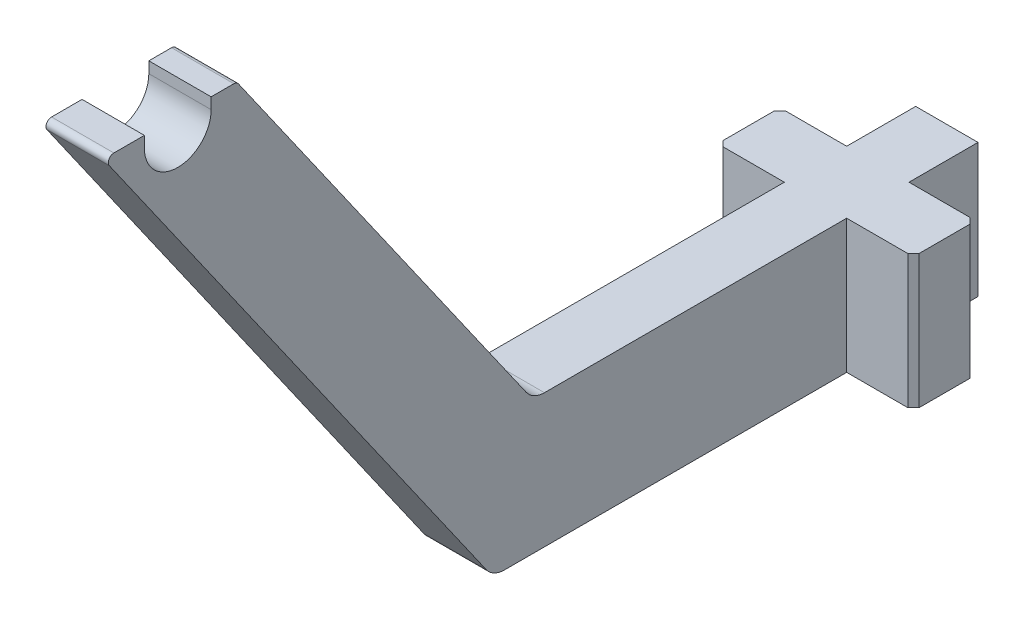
ISO-10303-21;
HEADER;
FILE_DESCRIPTION(('STEP AP214'),'2;1');
FILE_NAME('part.step','',(''),(''),'','','');
FILE_SCHEMA(('AUTOMOTIVE_DESIGN { 1 0 10303 214 1 1 1 1 }'));
ENDSEC;
DATA;
#1=APPLICATION_CONTEXT('core data for automotive mechanical design processes');
#2=APPLICATION_PROTOCOL_DEFINITION('international standard','automotive_design',2000,#1);
#3=PRODUCT_CONTEXT('',#1,'mechanical');
#4=PRODUCT('Part','Part','',(#3));
#5=PRODUCT_RELATED_PRODUCT_CATEGORY('part','',(#4));
#6=PRODUCT_DEFINITION_FORMATION('','',#4);
#7=PRODUCT_DEFINITION_CONTEXT('part definition',#1,'design');
#8=PRODUCT_DEFINITION('design','',#6,#7);
#9=PRODUCT_DEFINITION_SHAPE('','',#8);
#10=(LENGTH_UNIT() NAMED_UNIT(*) SI_UNIT(.MILLI.,.METRE.));
#11=(NAMED_UNIT(*) PLANE_ANGLE_UNIT() SI_UNIT($,.RADIAN.));
#12=(NAMED_UNIT(*) SI_UNIT($,.STERADIAN.) SOLID_ANGLE_UNIT());
#13=UNCERTAINTY_MEASURE_WITH_UNIT(LENGTH_MEASURE(1.E-05),#10,'distance_accuracy_value','');
#14=(GEOMETRIC_REPRESENTATION_CONTEXT(3) GLOBAL_UNCERTAINTY_ASSIGNED_CONTEXT((#13)) GLOBAL_UNIT_ASSIGNED_CONTEXT((#10,
#11,#12)) REPRESENTATION_CONTEXT('',''));
#15=CARTESIAN_POINT('',(0.,0.,0.));
#16=DIRECTION('',(0.,0.,1.));
#17=DIRECTION('',(1.,0.,0.));
#18=AXIS2_PLACEMENT_3D('',#15,#16,#17);
#19=CARTESIAN_POINT('',(1.4,25.,39.3039432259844));
#20=DIRECTION('',(0.,-1.,0.));
#21=DIRECTION('',(0.,0.,-1.));
#22=AXIS2_PLACEMENT_3D('',#19,#20,#21);
#23=PLANE('',#22);
#24=DIRECTION('',(0.,0.,1.));
#25=VECTOR('',#24,1.);
#26=CARTESIAN_POINT('',(-1.4,25.,39.3039432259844));
#27=LINE('',#26,#25);
#28=CARTESIAN_POINT('',(-1.4,25.,37.4538394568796));
#29=VERTEX_POINT('',#28);
#30=CARTESIAN_POINT('',(-1.4,25.,38.8236976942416));
#31=VERTEX_POINT('',#30);
#32=EDGE_CURVE('E223',#29,#31,#27,.T.);
#33=ORIENTED_EDGE('',*,*,#32,.T.);
#34=DIRECTION('',(-1.,0.,0.));
#35=VECTOR('',#34,1.);
#36=CARTESIAN_POINT('',(1.4,25.,38.8236976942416));
#37=LINE('',#36,#35);
#38=CARTESIAN_POINT('',(1.4,25.,38.8236976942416));
#39=VERTEX_POINT('',#38);
#40=EDGE_CURVE('E312',#31,#39,#37,.F.);
#41=ORIENTED_EDGE('',*,*,#40,.T.);
#42=DIRECTION('',(0.,0.,1.));
#43=VECTOR('',#42,1.);
#44=CARTESIAN_POINT('',(1.4,25.,39.3039432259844));
#45=LINE('',#44,#43);
#46=CARTESIAN_POINT('',(1.4,25.,37.4538394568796));
#47=VERTEX_POINT('',#46);
#48=EDGE_CURVE('E226',#47,#39,#45,.T.);
#49=ORIENTED_EDGE('',*,*,#48,.F.);
#50=DIRECTION('',(-1.,0.,0.));
#51=VECTOR('',#50,1.);
#52=CARTESIAN_POINT('',(4.400025,25.,37.4538394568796));
#53=LINE('',#52,#51);
#54=EDGE_CURVE('E210',#47,#29,#53,.T.);
#55=ORIENTED_EDGE('',*,*,#54,.T.);
#56=EDGE_LOOP('',(#33,#41,#49,#55));
#57=FACE_BOUND('',#56,.T.);
#58=ADVANCED_FACE('F35',(#57),#23,.F.);
#59=CARTESIAN_POINT('',(1.4,0.,0.));
#60=DIRECTION('',(-1.,0.,0.));
#61=DIRECTION('',(0.,0.,1.));
#62=AXIS2_PLACEMENT_3D('',#59,#60,#61);
#63=PLANE('',#62);
#64=DIRECTION('',(0.,1.,0.));
#65=VECTOR('',#64,1.);
#66=CARTESIAN_POINT('',(1.4,-4.10365690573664,3.1));
#67=LINE('',#66,#65);
#68=CARTESIAN_POINT('',(1.4,0.,3.1));
#69=VERTEX_POINT('',#68);
#70=CARTESIAN_POINT('',(1.4,6.,3.1));
#71=VERTEX_POINT('',#70);
#72=EDGE_CURVE('E334',#69,#71,#67,.T.);
#73=ORIENTED_EDGE('',*,*,#72,.F.);
#74=DIRECTION('',(0.,0.,-1.));
#75=VECTOR('',#74,1.);
#76=CARTESIAN_POINT('',(1.4,0.,0.));
#77=LINE('',#76,#75);
#78=CARTESIAN_POINT('',(1.4,0.,0.));
#79=VERTEX_POINT('',#78);
#80=EDGE_CURVE('E243',#69,#79,#77,.T.);
#81=ORIENTED_EDGE('',*,*,#80,.T.);
#82=DIRECTION('',(0.,1.,0.));
#83=VECTOR('',#82,1.);
#84=CARTESIAN_POINT('',(1.4,0.,0.));
#85=LINE('',#84,#83);
#86=CARTESIAN_POINT('',(1.4,6.,0.));
#87=VERTEX_POINT('',#86);
#88=EDGE_CURVE('E273',#79,#87,#85,.T.);
#89=ORIENTED_EDGE('',*,*,#88,.T.);
#90=DIRECTION('',(0.,0.,1.));
#91=VECTOR('',#90,1.);
#92=CARTESIAN_POINT('',(1.4,6.,0.));
#93=LINE('',#92,#91);
#94=EDGE_CURVE('E288',#87,#71,#93,.T.);
#95=ORIENTED_EDGE('',*,*,#94,.T.);
#96=EDGE_LOOP('',(#73,#81,#89,#95));
#97=FACE_BOUND('',#96,.T.);
#98=ADVANCED_FACE('F480',(#97),#63,.F.);
#99=CARTESIAN_POINT('',(-1.4,0.,0.));
#100=DIRECTION('',(-1.,0.,0.));
#101=DIRECTION('',(0.,0.,1.));
#102=AXIS2_PLACEMENT_3D('',#99,#100,#101);
#103=PLANE('',#102);
#104=DIRECTION('',(0.,0.,-1.));
#105=VECTOR('',#104,1.);
#106=CARTESIAN_POINT('',(-1.4,0.,0.));
#107=LINE('',#106,#105);
#108=CARTESIAN_POINT('',(-1.4,0.,3.1));
#109=VERTEX_POINT('',#108);
#110=CARTESIAN_POINT('',(-1.4,0.,0.));
#111=VERTEX_POINT('',#110);
#112=EDGE_CURVE('E252',#109,#111,#107,.T.);
#113=ORIENTED_EDGE('',*,*,#112,.F.);
#114=DIRECTION('',(0.,1.,0.));
#115=VECTOR('',#114,1.);
#116=CARTESIAN_POINT('',(-1.4,-4.10365690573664,3.1));
#117=LINE('',#116,#115);
#118=CARTESIAN_POINT('',(-1.4,6.,3.1));
#119=VERTEX_POINT('',#118);
#120=EDGE_CURVE('E404',#109,#119,#117,.T.);
#121=ORIENTED_EDGE('',*,*,#120,.T.);
#122=DIRECTION('',(0.,0.,1.));
#123=VECTOR('',#122,1.);
#124=CARTESIAN_POINT('',(-1.4,6.,0.));
#125=LINE('',#124,#123);
#126=CARTESIAN_POINT('',(-1.4,6.,0.));
#127=VERTEX_POINT('',#126);
#128=EDGE_CURVE('E238',#127,#119,#125,.T.);
#129=ORIENTED_EDGE('',*,*,#128,.F.);
#130=DIRECTION('',(0.,1.,0.));
#131=VECTOR('',#130,1.);
#132=CARTESIAN_POINT('',(-1.4,0.,0.));
#133=LINE('',#132,#131);
#134=EDGE_CURVE('E262',#111,#127,#133,.T.);
#135=ORIENTED_EDGE('',*,*,#134,.F.);
#136=EDGE_LOOP('',(#113,#121,#129,#135));
#137=FACE_BOUND('',#136,.T.);
#138=ADVANCED_FACE('F462',(#137),#103,.T.);
#139=CARTESIAN_POINT('',(1.4,0.,0.));
#140=DIRECTION('',(0.,1.,0.));
#141=DIRECTION('',(0.,0.,1.));
#142=AXIS2_PLACEMENT_3D('',#139,#140,#141);
#143=PLANE('',#142);
#144=DIRECTION('',(-1.,0.,0.));
#145=VECTOR('',#144,1.);
#146=CARTESIAN_POINT('',(-4.4,0.,5.9));
#147=LINE('',#146,#145);
#148=CARTESIAN_POINT('',(-1.4,0.,5.9));
#149=VERTEX_POINT('',#148);
#150=CARTESIAN_POINT('',(-4.15,0.,5.9));
#151=VERTEX_POINT('',#150);
#152=EDGE_CURVE('E398',#149,#151,#147,.T.);
#153=ORIENTED_EDGE('',*,*,#152,.T.);
#154=DIRECTION('',(0.707106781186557,0.,0.707106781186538));
#155=VECTOR('',#154,1.);
#156=CARTESIAN_POINT('',(-4.4,0.,5.65000000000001));
#157=LINE('',#156,#155);
#158=CARTESIAN_POINT('',(-4.4,0.,5.65000000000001));
#159=VERTEX_POINT('',#158);
#160=EDGE_CURVE('E365',#151,#159,#157,.F.);
#161=ORIENTED_EDGE('',*,*,#160,.T.);
#162=DIRECTION('',(0.,0.,-1.));
#163=VECTOR('',#162,1.);
#164=CARTESIAN_POINT('',(-4.4,0.,3.1));
#165=LINE('',#164,#163);
#166=CARTESIAN_POINT('',(-4.4,0.,3.35));
#167=VERTEX_POINT('',#166);
#168=EDGE_CURVE('E395',#159,#167,#165,.T.);
#169=ORIENTED_EDGE('',*,*,#168,.T.);
#170=DIRECTION('',(-0.707106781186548,0.,0.707106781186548));
#171=VECTOR('',#170,1.);
#172=CARTESIAN_POINT('',(-4.15,0.,3.1));
#173=LINE('',#172,#171);
#174=CARTESIAN_POINT('',(-4.15,0.,3.1));
#175=VERTEX_POINT('',#174);
#176=EDGE_CURVE('E363',#167,#175,#173,.F.);
#177=ORIENTED_EDGE('',*,*,#176,.T.);
#178=DIRECTION('',(1.,0.,0.));
#179=VECTOR('',#178,1.);
#180=CARTESIAN_POINT('',(-1.4,0.,3.1));
#181=LINE('',#180,#179);
#182=EDGE_CURVE('E256',#175,#109,#181,.T.);
#183=ORIENTED_EDGE('',*,*,#182,.T.);
#184=ORIENTED_EDGE('',*,*,#112,.T.);
#185=DIRECTION('',(-1.,0.,0.));
#186=VECTOR('',#185,1.);
#187=CARTESIAN_POINT('',(1.4,0.,0.));
#188=LINE('',#187,#186);
#189=EDGE_CURVE('E247',#79,#111,#188,.T.);
#190=ORIENTED_EDGE('',*,*,#189,.F.);
#191=ORIENTED_EDGE('',*,*,#80,.F.);
#192=DIRECTION('',(1.,0.,0.));
#193=VECTOR('',#192,1.);
#194=CARTESIAN_POINT('',(1.4,0.,3.1));
#195=LINE('',#194,#193);
#196=CARTESIAN_POINT('',(4.15,0.,3.1));
#197=VERTEX_POINT('',#196);
#198=EDGE_CURVE('E342',#69,#197,#195,.T.);
#199=ORIENTED_EDGE('',*,*,#198,.T.);
#200=DIRECTION('',(-0.707106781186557,0.,-0.707106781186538));
#201=VECTOR('',#200,1.);
#202=CARTESIAN_POINT('',(4.4,0.,3.34999999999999));
#203=LINE('',#202,#201);
#204=CARTESIAN_POINT('',(4.4,0.,3.34999999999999));
#205=VERTEX_POINT('',#204);
#206=EDGE_CURVE('E359',#197,#205,#203,.F.);
#207=ORIENTED_EDGE('',*,*,#206,.T.);
#208=DIRECTION('',(0.,0.,1.));
#209=VECTOR('',#208,1.);
#210=CARTESIAN_POINT('',(4.4,0.,3.1));
#211=LINE('',#210,#209);
#212=CARTESIAN_POINT('',(4.4,0.,5.65));
#213=VERTEX_POINT('',#212);
#214=EDGE_CURVE('E356',#205,#213,#211,.T.);
#215=ORIENTED_EDGE('',*,*,#214,.T.);
#216=DIRECTION('',(0.707106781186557,0.,-0.707106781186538));
#217=VECTOR('',#216,1.);
#218=CARTESIAN_POINT('',(4.15,0.,5.9));
#219=LINE('',#218,#217);
#220=CARTESIAN_POINT('',(4.15,0.,5.9));
#221=VERTEX_POINT('',#220);
#222=EDGE_CURVE('E50',#213,#221,#219,.F.);
#223=ORIENTED_EDGE('',*,*,#222,.T.);
#224=DIRECTION('',(-1.,0.,0.));
#225=VECTOR('',#224,1.);
#226=CARTESIAN_POINT('',(4.4,0.,5.9));
#227=LINE('',#226,#225);
#228=CARTESIAN_POINT('',(1.4,0.,5.9));
#229=VERTEX_POINT('',#228);
#230=EDGE_CURVE('E345',#221,#229,#227,.T.);
#231=ORIENTED_EDGE('',*,*,#230,.T.);
#232=CARTESIAN_POINT('',(1.4,0.,21.27818772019));
#233=VERTEX_POINT('',#232);
#234=EDGE_CURVE('E269',#233,#229,#77,.T.);
#235=ORIENTED_EDGE('',*,*,#234,.F.);
#236=DIRECTION('',(-1.,0.,0.));
#237=VECTOR('',#236,1.);
#238=CARTESIAN_POINT('',(1.4,0.,21.27818772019));
#239=LINE('',#238,#237);
#240=CARTESIAN_POINT('',(-1.4,0.,21.27818772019));
#241=VERTEX_POINT('',#240);
#242=EDGE_CURVE('E274',#233,#241,#239,.T.);
#243=ORIENTED_EDGE('',*,*,#242,.T.);
#244=EDGE_CURVE('E255',#241,#149,#107,.T.);
#245=ORIENTED_EDGE('',*,*,#244,.T.);
#246=EDGE_LOOP('',(#153,#161,#169,#177,#183,#184,#190,#191,#199,#207,#215,#223,#231,#235,#243,#245));
#247=FACE_BOUND('',#246,.T.);
#248=ADVANCED_FACE('F439',(#247),#143,.F.);
#249=CARTESIAN_POINT('',(1.4,0.,0.));
#250=DIRECTION('',(0.,0.,1.));
#251=DIRECTION('',(1.,0.,0.));
#252=AXIS2_PLACEMENT_3D('',#249,#250,#251);
#253=PLANE('',#252);
#254=ORIENTED_EDGE('',*,*,#134,.T.);
#255=DIRECTION('',(-1.,0.,0.));
#256=VECTOR('',#255,1.);
#257=CARTESIAN_POINT('',(1.4,6.,0.));
#258=LINE('',#257,#256);
#259=EDGE_CURVE('E244',#87,#127,#258,.T.);
#260=ORIENTED_EDGE('',*,*,#259,.F.);
#261=ORIENTED_EDGE('',*,*,#88,.F.);
#262=ORIENTED_EDGE('',*,*,#189,.T.);
#263=EDGE_LOOP('',(#254,#260,#261,#262));
#264=FACE_BOUND('',#263,.T.);
#265=ADVANCED_FACE('F456',(#264),#253,.F.);
#266=CARTESIAN_POINT('',(1.4,6.,0.));
#267=DIRECTION('',(0.,-1.,0.));
#268=DIRECTION('',(0.,0.,-1.));
#269=AXIS2_PLACEMENT_3D('',#266,#267,#268);
#270=PLANE('',#269);
#271=DIRECTION('',(0.,0.,1.));
#272=VECTOR('',#271,1.);
#273=CARTESIAN_POINT('',(-4.4,6.,3.1));
#274=LINE('',#273,#272);
#275=CARTESIAN_POINT('',(-4.4,6.,3.35));
#276=VERTEX_POINT('',#275);
#277=CARTESIAN_POINT('',(-4.4,6.,5.65000000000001));
#278=VERTEX_POINT('',#277);
#279=EDGE_CURVE('E400',#276,#278,#274,.T.);
#280=ORIENTED_EDGE('',*,*,#279,.T.);
#281=DIRECTION('',(-0.707106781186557,0.,-0.707106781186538));
#282=VECTOR('',#281,1.);
#283=CARTESIAN_POINT('',(-4.4,6.,5.65000000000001));
#284=LINE('',#283,#282);
#285=CARTESIAN_POINT('',(-4.15,6.,5.9));
#286=VERTEX_POINT('',#285);
#287=EDGE_CURVE('E428',#278,#286,#284,.F.);
#288=ORIENTED_EDGE('',*,*,#287,.T.);
#289=DIRECTION('',(1.,0.,0.));
#290=VECTOR('',#289,1.);
#291=CARTESIAN_POINT('',(-4.4,6.,5.9));
#292=LINE('',#291,#290);
#293=CARTESIAN_POINT('',(-1.4,6.,5.9));
#294=VERTEX_POINT('',#293);
#295=EDGE_CURVE('E336',#286,#294,#292,.T.);
#296=ORIENTED_EDGE('',*,*,#295,.T.);
#297=CARTESIAN_POINT('',(-1.4,6.,19.4794329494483));
#298=VERTEX_POINT('',#297);
#299=EDGE_CURVE('E405',#294,#298,#125,.T.);
#300=ORIENTED_EDGE('',*,*,#299,.T.);
#301=DIRECTION('',(-1.,0.,0.));
#302=VECTOR('',#301,1.);
#303=CARTESIAN_POINT('',(1.4,6.,19.4794329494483));
#304=LINE('',#303,#302);
#305=CARTESIAN_POINT('',(1.4,6.,19.4794329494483));
#306=VERTEX_POINT('',#305);
#307=EDGE_CURVE('E267',#298,#306,#304,.F.);
#308=ORIENTED_EDGE('',*,*,#307,.T.);
#309=CARTESIAN_POINT('',(1.4,6.,5.9));
#310=VERTEX_POINT('',#309);
#311=EDGE_CURVE('E292',#310,#306,#93,.T.);
#312=ORIENTED_EDGE('',*,*,#311,.F.);
#313=DIRECTION('',(1.,0.,0.));
#314=VECTOR('',#313,1.);
#315=CARTESIAN_POINT('',(4.4,6.,5.9));
#316=LINE('',#315,#314);
#317=CARTESIAN_POINT('',(4.15,6.,5.9));
#318=VERTEX_POINT('',#317);
#319=EDGE_CURVE('E386',#310,#318,#316,.T.);
#320=ORIENTED_EDGE('',*,*,#319,.T.);
#321=DIRECTION('',(-0.707106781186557,0.,0.707106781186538));
#322=VECTOR('',#321,1.);
#323=CARTESIAN_POINT('',(4.15,6.,5.9));
#324=LINE('',#323,#322);
#325=CARTESIAN_POINT('',(4.4,6.,5.65));
#326=VERTEX_POINT('',#325);
#327=EDGE_CURVE('E385',#318,#326,#324,.F.);
#328=ORIENTED_EDGE('',*,*,#327,.T.);
#329=DIRECTION('',(0.,0.,-1.));
#330=VECTOR('',#329,1.);
#331=CARTESIAN_POINT('',(4.4,6.,3.1));
#332=LINE('',#331,#330);
#333=CARTESIAN_POINT('',(4.4,6.,3.35));
#334=VERTEX_POINT('',#333);
#335=EDGE_CURVE('E335',#326,#334,#332,.T.);
#336=ORIENTED_EDGE('',*,*,#335,.T.);
#337=DIRECTION('',(0.707106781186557,0.,0.707106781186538));
#338=VECTOR('',#337,1.);
#339=CARTESIAN_POINT('',(4.4,6.,3.34999999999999));
#340=LINE('',#339,#338);
#341=CARTESIAN_POINT('',(4.15,6.,3.1));
#342=VERTEX_POINT('',#341);
#343=EDGE_CURVE('E330',#334,#342,#340,.F.);
#344=ORIENTED_EDGE('',*,*,#343,.T.);
#345=DIRECTION('',(-1.,0.,0.));
#346=VECTOR('',#345,1.);
#347=CARTESIAN_POINT('',(1.4,6.,3.1));
#348=LINE('',#347,#346);
#349=EDGE_CURVE('E331',#342,#71,#348,.T.);
#350=ORIENTED_EDGE('',*,*,#349,.T.);
#351=ORIENTED_EDGE('',*,*,#94,.F.);
#352=ORIENTED_EDGE('',*,*,#259,.T.);
#353=ORIENTED_EDGE('',*,*,#128,.T.);
#354=DIRECTION('',(-1.,0.,0.));
#355=VECTOR('',#354,1.);
#356=CARTESIAN_POINT('',(-1.4,6.,3.1));
#357=LINE('',#356,#355);
#358=CARTESIAN_POINT('',(-4.15,6.,3.1));
#359=VERTEX_POINT('',#358);
#360=EDGE_CURVE('E394',#119,#359,#357,.T.);
#361=ORIENTED_EDGE('',*,*,#360,.T.);
#362=DIRECTION('',(0.707106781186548,0.,-0.707106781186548));
#363=VECTOR('',#362,1.);
#364=CARTESIAN_POINT('',(-4.15,6.,3.1));
#365=LINE('',#364,#363);
#366=EDGE_CURVE('E416',#359,#276,#365,.F.);
#367=ORIENTED_EDGE('',*,*,#366,.T.);
#368=EDGE_LOOP('',(#280,#288,#296,#300,#308,#312,#320,#328,#336,#344,#350,#351,#352,#353,#361,#367));
#369=FACE_BOUND('',#368,.T.);
#370=ADVANCED_FACE('F382',(#369),#270,.F.);
#371=CARTESIAN_POINT('',(1.4,6.,20.));
#372=DIRECTION('',(0.,-0.573576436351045,0.819152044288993));
#373=DIRECTION('',(0.,-0.819152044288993,-0.573576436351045));
#374=AXIS2_PLACEMENT_3D('',#371,#372,#373);
#375=PLANE('',#374);
#376=DIRECTION('',(0.,0.819152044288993,0.573576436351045));
#377=VECTOR('',#376,1.);
#378=CARTESIAN_POINT('',(-1.4,6.,20.));
#379=LINE('',#378,#377);
#380=CARTESIAN_POINT('',(-1.4,6.42642356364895,20.2985849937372));
#381=VERTEX_POINT('',#380);
#382=CARTESIAN_POINT('',(-1.4,24.8933941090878,33.2292969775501));
#383=VERTEX_POINT('',#382);
#384=EDGE_CURVE('E234',#381,#383,#379,.T.);
#385=ORIENTED_EDGE('',*,*,#384,.T.);
#386=DIRECTION('',(-1.,0.,0.));
#387=VECTOR('',#386,1.);
#388=CARTESIAN_POINT('',(1.4,24.8933941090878,33.2292969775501));
#389=LINE('',#388,#387);
#390=CARTESIAN_POINT('',(1.4,24.8933941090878,33.2292969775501));
#391=VERTEX_POINT('',#390);
#392=EDGE_CURVE('E319',#383,#391,#389,.F.);
#393=ORIENTED_EDGE('',*,*,#392,.T.);
#394=DIRECTION('',(0.,0.819152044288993,0.573576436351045));
#395=VECTOR('',#394,1.);
#396=CARTESIAN_POINT('',(1.4,6.,20.));
#397=LINE('',#396,#395);
#398=CARTESIAN_POINT('',(1.4,6.42642356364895,20.2985849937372));
#399=VERTEX_POINT('',#398);
#400=EDGE_CURVE('E291',#399,#391,#397,.T.);
#401=ORIENTED_EDGE('',*,*,#400,.F.);
#402=DIRECTION('',(-1.,0.,0.));
#403=VECTOR('',#402,1.);
#404=CARTESIAN_POINT('',(-1.4,6.42642356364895,20.2985849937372));
#405=LINE('',#404,#403);
#406=EDGE_CURVE('E251',#399,#381,#405,.T.);
#407=ORIENTED_EDGE('',*,*,#406,.T.);
#408=EDGE_LOOP('',(#385,#393,#401,#407));
#409=FACE_BOUND('',#408,.T.);
#410=ADVANCED_FACE('F497',(#409),#375,.F.);
#411=CARTESIAN_POINT('',(1.4,25.,33.4340849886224));
#412=VERTEX_POINT('',#411);
#413=CARTESIAN_POINT('',(1.4,25.,34.4538394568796));
#414=VERTEX_POINT('',#413);
#415=EDGE_CURVE('E298',#412,#414,#45,.T.);
#416=ORIENTED_EDGE('',*,*,#415,.F.);
#417=DIRECTION('',(-1.,0.,0.));
#418=VECTOR('',#417,1.);
#419=CARTESIAN_POINT('',(1.4,25.,33.4340849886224));
#420=LINE('',#419,#418);
#421=CARTESIAN_POINT('',(-1.4,25.,33.4340849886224));
#422=VERTEX_POINT('',#421);
#423=EDGE_CURVE('E315',#412,#422,#420,.T.);
#424=ORIENTED_EDGE('',*,*,#423,.T.);
#425=CARTESIAN_POINT('',(-1.4,25.,34.4538394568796));
#426=VERTEX_POINT('',#425);
#427=EDGE_CURVE('E233',#422,#426,#27,.T.);
#428=ORIENTED_EDGE('',*,*,#427,.T.);
#429=DIRECTION('',(-1.,0.,0.));
#430=VECTOR('',#429,1.);
#431=CARTESIAN_POINT('',(4.400025,25.,34.4538394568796));
#432=LINE('',#431,#430);
#433=EDGE_CURVE('E227',#414,#426,#432,.T.);
#434=ORIENTED_EDGE('',*,*,#433,.F.);
#435=EDGE_LOOP('',(#416,#424,#428,#434));
#436=FACE_BOUND('',#435,.T.);
#437=ADVANCED_FACE('F517',(#436),#23,.F.);
#438=CARTESIAN_POINT('',(1.4,0.,21.7987547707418));
#439=DIRECTION('',(0.,0.573576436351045,-0.819152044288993));
#440=DIRECTION('',(0.,0.819152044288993,0.573576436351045));
#441=AXIS2_PLACEMENT_3D('',#438,#439,#440);
#442=PLANE('',#441);
#443=DIRECTION('',(0.,-0.819152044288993,-0.573576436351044));
#444=VECTOR('',#443,1.);
#445=CARTESIAN_POINT('',(1.4,0.,21.7987547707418));
#446=LINE('',#445,#444);
#447=CARTESIAN_POINT('',(1.4,24.6066058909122,39.0284857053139));
#448=VERTEX_POINT('',#447);
#449=CARTESIAN_POINT('',(1.4,0.426423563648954,22.097339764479));
#450=VERTEX_POINT('',#449);
#451=EDGE_CURVE('E248',#448,#450,#446,.T.);
#452=ORIENTED_EDGE('',*,*,#451,.F.);
#453=DIRECTION('',(-1.,0.,0.));
#454=VECTOR('',#453,1.);
#455=CARTESIAN_POINT('',(1.4,24.6066058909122,39.0284857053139));
#456=LINE('',#455,#454);
#457=CARTESIAN_POINT('',(-1.4,24.6066058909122,39.0284857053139));
#458=VERTEX_POINT('',#457);
#459=EDGE_CURVE('E314',#448,#458,#456,.T.);
#460=ORIENTED_EDGE('',*,*,#459,.T.);
#461=DIRECTION('',(0.,-0.819152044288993,-0.573576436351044));
#462=VECTOR('',#461,1.);
#463=CARTESIAN_POINT('',(-1.4,0.,21.7987547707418));
#464=LINE('',#463,#462);
#465=CARTESIAN_POINT('',(-1.4,0.426423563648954,22.097339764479));
#466=VERTEX_POINT('',#465);
#467=EDGE_CURVE('E236',#458,#466,#464,.T.);
#468=ORIENTED_EDGE('',*,*,#467,.T.);
#469=DIRECTION('',(-1.,0.,0.));
#470=VECTOR('',#469,1.);
#471=CARTESIAN_POINT('',(1.4,0.426423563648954,22.097339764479));
#472=LINE('',#471,#470);
#473=EDGE_CURVE('E490',#466,#450,#472,.F.);
#474=ORIENTED_EDGE('',*,*,#473,.T.);
#475=EDGE_LOOP('',(#452,#460,#468,#474));
#476=FACE_BOUND('',#475,.T.);
#477=ADVANCED_FACE('F515',(#476),#442,.F.);
#478=ORIENTED_EDGE('',*,*,#48,.T.);
#479=CARTESIAN_POINT('',(1.4,24.75,38.8236976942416));
#480=DIRECTION('',(-1.,0.,0.));
#481=DIRECTION('',(0.,0.,1.));
#482=AXIS2_PLACEMENT_3D('',#479,#480,#481);
#483=CIRCLE('',#482,0.25);
#484=EDGE_CURVE('E305',#39,#448,#483,.F.);
#485=ORIENTED_EDGE('',*,*,#484,.T.);
#486=ORIENTED_EDGE('',*,*,#451,.T.);
#487=CARTESIAN_POINT('',(1.4,0.999999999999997,21.27818772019));
#488=DIRECTION('',(-1.,0.,0.));
#489=DIRECTION('',(0.,0.,1.));
#490=AXIS2_PLACEMENT_3D('',#487,#488,#489);
#491=CIRCLE('',#490,1.);
#492=EDGE_CURVE('E483',#450,#233,#491,.F.);
#493=ORIENTED_EDGE('',*,*,#492,.T.);
#494=ORIENTED_EDGE('',*,*,#234,.T.);
#495=DIRECTION('',(0.,1.,0.));
#496=VECTOR('',#495,1.);
#497=CARTESIAN_POINT('',(1.4,-4.10365690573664,5.9));
#498=LINE('',#497,#496);
#499=EDGE_CURVE('E346',#229,#310,#498,.T.);
#500=ORIENTED_EDGE('',*,*,#499,.T.);
#501=ORIENTED_EDGE('',*,*,#311,.T.);
#502=CARTESIAN_POINT('',(1.4,7.,19.4794329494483));
#503=DIRECTION('',(-1.,0.,0.));
#504=DIRECTION('',(0.,0.,1.));
#505=AXIS2_PLACEMENT_3D('',#502,#503,#504);
#506=CIRCLE('',#505,1.);
#507=EDGE_CURVE('E507',#306,#399,#506,.T.);
#508=ORIENTED_EDGE('',*,*,#507,.T.);
#509=ORIENTED_EDGE('',*,*,#400,.T.);
#510=CARTESIAN_POINT('',(1.4,24.75,33.4340849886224));
#511=DIRECTION('',(-1.,0.,0.));
#512=DIRECTION('',(0.,0.,1.));
#513=AXIS2_PLACEMENT_3D('',#510,#511,#512);
#514=CIRCLE('',#513,0.25);
#515=EDGE_CURVE('E316',#391,#412,#514,.F.);
#516=ORIENTED_EDGE('',*,*,#515,.T.);
#517=ORIENTED_EDGE('',*,*,#415,.T.);
#518=DIRECTION('',(0.,-1.,0.));
#519=VECTOR('',#518,1.);
#520=CARTESIAN_POINT('',(1.4,0.,34.4538394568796));
#521=LINE('',#520,#519);
#522=CARTESIAN_POINT('',(1.4,24.5,34.4538394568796));
#523=VERTEX_POINT('',#522);
#524=EDGE_CURVE('E765',#414,#523,#521,.T.);
#525=ORIENTED_EDGE('',*,*,#524,.T.);
#526=CARTESIAN_POINT('',(1.4,24.5,35.9538394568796));
#527=DIRECTION('',(-1.,0.,0.));
#528=DIRECTION('',(0.,0.,1.));
#529=AXIS2_PLACEMENT_3D('',#526,#527,#528);
#530=CIRCLE('',#529,1.5);
#531=CARTESIAN_POINT('',(1.4,24.5,37.4538394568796));
#532=VERTEX_POINT('',#531);
#533=EDGE_CURVE('E758',#523,#532,#530,.T.);
#534=ORIENTED_EDGE('',*,*,#533,.T.);
#535=DIRECTION('',(0.,1.,0.));
#536=VECTOR('',#535,1.);
#537=CARTESIAN_POINT('',(1.4,0.,37.4538394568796));
#538=LINE('',#537,#536);
#539=EDGE_CURVE('E308',#532,#47,#538,.T.);
#540=ORIENTED_EDGE('',*,*,#539,.T.);
#541=EDGE_LOOP('',(#478,#485,#486,#493,#494,#500,#501,#508,#509,#516,#517,#525,#534,#540));
#542=FACE_BOUND('',#541,.T.);
#543=ADVANCED_FACE('F304',(#542),#63,.F.);
#544=ORIENTED_EDGE('',*,*,#467,.F.);
#545=CARTESIAN_POINT('',(-1.4,24.75,38.8236976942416));
#546=DIRECTION('',(-1.,0.,0.));
#547=DIRECTION('',(0.,0.,1.));
#548=AXIS2_PLACEMENT_3D('',#545,#546,#547);
#549=CIRCLE('',#548,0.25);
#550=EDGE_CURVE('E232',#458,#31,#549,.T.);
#551=ORIENTED_EDGE('',*,*,#550,.T.);
#552=ORIENTED_EDGE('',*,*,#32,.F.);
#553=DIRECTION('',(0.,1.,0.));
#554=VECTOR('',#553,1.);
#555=CARTESIAN_POINT('',(-1.4,25.,37.4538394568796));
#556=LINE('',#555,#554);
#557=CARTESIAN_POINT('',(-1.4,24.5,37.4538394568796));
#558=VERTEX_POINT('',#557);
#559=EDGE_CURVE('E207',#558,#29,#556,.T.);
#560=ORIENTED_EDGE('',*,*,#559,.F.);
#561=CARTESIAN_POINT('',(-1.4,24.5,35.9538394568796));
#562=DIRECTION('',(-1.,0.,0.));
#563=DIRECTION('',(0.,0.,1.));
#564=AXIS2_PLACEMENT_3D('',#561,#562,#563);
#565=CIRCLE('',#564,1.5);
#566=CARTESIAN_POINT('',(-1.4,24.5,34.4538394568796));
#567=VERTEX_POINT('',#566);
#568=EDGE_CURVE('E228',#567,#558,#565,.T.);
#569=ORIENTED_EDGE('',*,*,#568,.F.);
#570=DIRECTION('',(0.,-1.,0.));
#571=VECTOR('',#570,1.);
#572=CARTESIAN_POINT('',(-1.4,24.5,34.4538394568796));
#573=LINE('',#572,#571);
#574=EDGE_CURVE('E218',#426,#567,#573,.T.);
#575=ORIENTED_EDGE('',*,*,#574,.F.);
#576=ORIENTED_EDGE('',*,*,#427,.F.);
#577=CARTESIAN_POINT('',(-1.4,24.75,33.4340849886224));
#578=DIRECTION('',(-1.,0.,0.));
#579=DIRECTION('',(0.,0.,1.));
#580=AXIS2_PLACEMENT_3D('',#577,#578,#579);
#581=CIRCLE('',#580,0.25);
#582=EDGE_CURVE('E501',#422,#383,#581,.T.);
#583=ORIENTED_EDGE('',*,*,#582,.T.);
#584=ORIENTED_EDGE('',*,*,#384,.F.);
#585=CARTESIAN_POINT('',(-1.4,7.,19.4794329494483));
#586=DIRECTION('',(-1.,0.,0.));
#587=DIRECTION('',(0.,0.,1.));
#588=AXIS2_PLACEMENT_3D('',#585,#586,#587);
#589=CIRCLE('',#588,1.);
#590=EDGE_CURVE('E452',#381,#298,#589,.F.);
#591=ORIENTED_EDGE('',*,*,#590,.T.);
#592=ORIENTED_EDGE('',*,*,#299,.F.);
#593=DIRECTION('',(0.,1.,0.));
#594=VECTOR('',#593,1.);
#595=CARTESIAN_POINT('',(-1.4,-4.10365690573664,5.9));
#596=LINE('',#595,#594);
#597=EDGE_CURVE('E399',#149,#294,#596,.T.);
#598=ORIENTED_EDGE('',*,*,#597,.F.);
#599=ORIENTED_EDGE('',*,*,#244,.F.);
#600=CARTESIAN_POINT('',(-1.4,0.999999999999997,21.27818772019));
#601=DIRECTION('',(-1.,0.,0.));
#602=DIRECTION('',(0.,0.,1.));
#603=AXIS2_PLACEMENT_3D('',#600,#601,#602);
#604=CIRCLE('',#603,1.);
#605=EDGE_CURVE('E489',#241,#466,#604,.T.);
#606=ORIENTED_EDGE('',*,*,#605,.T.);
#607=EDGE_LOOP('',(#544,#551,#552,#560,#569,#575,#576,#583,#584,#591,#592,#598,#599,#606));
#608=FACE_BOUND('',#607,.T.);
#609=ADVANCED_FACE('F231',(#608),#103,.T.);
#610=CARTESIAN_POINT('',(-4.4,-4.10365690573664,5.9));
#611=DIRECTION('',(0.,0.,1.));
#612=DIRECTION('',(0.,-1.,0.));
#613=AXIS2_PLACEMENT_3D('',#610,#611,#612);
#614=PLANE('',#613);
#615=ORIENTED_EDGE('',*,*,#295,.F.);
#616=DIRECTION('',(0.,-1.,0.));
#617=VECTOR('',#616,1.);
#618=CARTESIAN_POINT('',(-4.15,-4.10365690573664,5.9));
#619=LINE('',#618,#617);
#620=EDGE_CURVE('E361',#286,#151,#619,.T.);
#621=ORIENTED_EDGE('',*,*,#620,.T.);
#622=ORIENTED_EDGE('',*,*,#152,.F.);
#623=ORIENTED_EDGE('',*,*,#597,.T.);
#624=EDGE_LOOP('',(#615,#621,#622,#623));
#625=FACE_BOUND('',#624,.T.);
#626=ADVANCED_FACE('F436',(#625),#614,.T.);
#627=CARTESIAN_POINT('',(-4.4,-4.10365690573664,3.1));
#628=DIRECTION('',(-1.,0.,0.));
#629=DIRECTION('',(0.,0.,1.));
#630=AXIS2_PLACEMENT_3D('',#627,#628,#629);
#631=PLANE('',#630);
#632=ORIENTED_EDGE('',*,*,#168,.F.);
#633=DIRECTION('',(0.,1.,0.));
#634=VECTOR('',#633,1.);
#635=CARTESIAN_POINT('',(-4.4,-4.10365690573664,5.65000000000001));
#636=LINE('',#635,#634);
#637=EDGE_CURVE('E327',#159,#278,#636,.T.);
#638=ORIENTED_EDGE('',*,*,#637,.T.);
#639=ORIENTED_EDGE('',*,*,#279,.F.);
#640=DIRECTION('',(0.,-1.,0.));
#641=VECTOR('',#640,1.);
#642=CARTESIAN_POINT('',(-4.4,-4.10365690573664,3.35));
#643=LINE('',#642,#641);
#644=EDGE_CURVE('E325',#276,#167,#643,.T.);
#645=ORIENTED_EDGE('',*,*,#644,.T.);
#646=EDGE_LOOP('',(#632,#638,#639,#645));
#647=FACE_BOUND('',#646,.T.);
#648=ADVANCED_FACE('F447',(#647),#631,.T.);
#649=CARTESIAN_POINT('',(-1.4,-4.10365690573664,3.1));
#650=DIRECTION('',(0.,0.,-1.));
#651=DIRECTION('',(0.,1.,0.));
#652=AXIS2_PLACEMENT_3D('',#649,#650,#651);
#653=PLANE('',#652);
#654=ORIENTED_EDGE('',*,*,#182,.F.);
#655=DIRECTION('',(0.,1.,0.));
#656=VECTOR('',#655,1.);
#657=CARTESIAN_POINT('',(-4.15,-4.10365690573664,3.1));
#658=LINE('',#657,#656);
#659=EDGE_CURVE('E367',#175,#359,#658,.T.);
#660=ORIENTED_EDGE('',*,*,#659,.T.);
#661=ORIENTED_EDGE('',*,*,#360,.F.);
#662=ORIENTED_EDGE('',*,*,#120,.F.);
#663=EDGE_LOOP('',(#654,#660,#661,#662));
#664=FACE_BOUND('',#663,.T.);
#665=ADVANCED_FACE('F422',(#664),#653,.T.);
#666=CARTESIAN_POINT('',(4.4,-4.10365690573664,5.9));
#667=DIRECTION('',(0.,0.,1.));
#668=DIRECTION('',(1.,0.,0.));
#669=AXIS2_PLACEMENT_3D('',#666,#667,#668);
#670=PLANE('',#669);
#671=ORIENTED_EDGE('',*,*,#230,.F.);
#672=DIRECTION('',(0.,1.,0.));
#673=VECTOR('',#672,1.);
#674=CARTESIAN_POINT('',(4.15,-4.10365690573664,5.9));
#675=LINE('',#674,#673);
#676=EDGE_CURVE('E370',#221,#318,#675,.T.);
#677=ORIENTED_EDGE('',*,*,#676,.T.);
#678=ORIENTED_EDGE('',*,*,#319,.F.);
#679=ORIENTED_EDGE('',*,*,#499,.F.);
#680=EDGE_LOOP('',(#671,#677,#678,#679));
#681=FACE_BOUND('',#680,.T.);
#682=ADVANCED_FACE('F475',(#681),#670,.T.);
#683=CARTESIAN_POINT('',(1.4,-4.10365690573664,3.1));
#684=DIRECTION('',(0.,0.,-1.));
#685=DIRECTION('',(-1.,0.,0.));
#686=AXIS2_PLACEMENT_3D('',#683,#684,#685);
#687=PLANE('',#686);
#688=ORIENTED_EDGE('',*,*,#349,.F.);
#689=DIRECTION('',(0.,-1.,0.));
#690=VECTOR('',#689,1.);
#691=CARTESIAN_POINT('',(4.15,-4.10365690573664,3.1));
#692=LINE('',#691,#690);
#693=EDGE_CURVE('E11',#342,#197,#692,.T.);
#694=ORIENTED_EDGE('',*,*,#693,.T.);
#695=ORIENTED_EDGE('',*,*,#198,.F.);
#696=ORIENTED_EDGE('',*,*,#72,.T.);
#697=EDGE_LOOP('',(#688,#694,#695,#696));
#698=FACE_BOUND('',#697,.T.);
#699=ADVANCED_FACE('F468',(#698),#687,.T.);
#700=CARTESIAN_POINT('',(4.4,-4.10365690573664,3.1));
#701=DIRECTION('',(1.,0.,0.));
#702=DIRECTION('',(0.,0.,-1.));
#703=AXIS2_PLACEMENT_3D('',#700,#701,#702);
#704=PLANE('',#703);
#705=ORIENTED_EDGE('',*,*,#335,.F.);
#706=DIRECTION('',(0.,-1.,0.));
#707=VECTOR('',#706,1.);
#708=CARTESIAN_POINT('',(4.4,-4.10365690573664,5.65));
#709=LINE('',#708,#707);
#710=EDGE_CURVE('E43',#326,#213,#709,.T.);
#711=ORIENTED_EDGE('',*,*,#710,.T.);
#712=ORIENTED_EDGE('',*,*,#214,.F.);
#713=DIRECTION('',(0.,1.,0.));
#714=VECTOR('',#713,1.);
#715=CARTESIAN_POINT('',(4.4,-4.10365690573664,3.34999999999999));
#716=LINE('',#715,#714);
#717=EDGE_CURVE('E373',#205,#334,#716,.T.);
#718=ORIENTED_EDGE('',*,*,#717,.T.);
#719=EDGE_LOOP('',(#705,#711,#712,#718));
#720=FACE_BOUND('',#719,.T.);
#721=ADVANCED_FACE('F377',(#720),#704,.T.);
#722=CARTESIAN_POINT('',(4.400025,25.,37.4538394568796));
#723=DIRECTION('',(0.,0.,1.));
#724=DIRECTION('',(1.,0.,0.));
#725=AXIS2_PLACEMENT_3D('',#722,#723,#724);
#726=PLANE('',#725);
#727=DIRECTION('',(-1.,0.,0.));
#728=VECTOR('',#727,1.);
#729=CARTESIAN_POINT('',(4.400025,24.5,37.4538394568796));
#730=LINE('',#729,#728);
#731=EDGE_CURVE('E213',#532,#558,#730,.T.);
#732=ORIENTED_EDGE('',*,*,#731,.T.);
#733=ORIENTED_EDGE('',*,*,#559,.T.);
#734=ORIENTED_EDGE('',*,*,#54,.F.);
#735=ORIENTED_EDGE('',*,*,#539,.F.);
#736=EDGE_LOOP('',(#732,#733,#734,#735));
#737=FACE_BOUND('',#736,.T.);
#738=ADVANCED_FACE('F209',(#737),#726,.F.);
#739=CARTESIAN_POINT('',(4.400025,24.5,35.9538394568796));
#740=DIRECTION('',(-1.,0.,0.));
#741=DIRECTION('',(0.,0.,1.));
#742=AXIS2_PLACEMENT_3D('',#739,#740,#741);
#743=CYLINDRICAL_SURFACE('',#742,1.5);
#744=DIRECTION('',(-1.,0.,0.));
#745=VECTOR('',#744,1.);
#746=CARTESIAN_POINT('',(4.400025,24.5,34.4538394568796));
#747=LINE('',#746,#745);
#748=EDGE_CURVE('E756',#523,#567,#747,.T.);
#749=ORIENTED_EDGE('',*,*,#748,.T.);
#750=ORIENTED_EDGE('',*,*,#568,.T.);
#751=ORIENTED_EDGE('',*,*,#731,.F.);
#752=ORIENTED_EDGE('',*,*,#533,.F.);
#753=EDGE_LOOP('',(#749,#750,#751,#752));
#754=FACE_BOUND('',#753,.T.);
#755=ADVANCED_FACE('F709',(#754),#743,.F.);
#756=CARTESIAN_POINT('',(4.400025,24.5,34.4538394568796));
#757=DIRECTION('',(0.,0.,-1.));
#758=DIRECTION('',(-1.,0.,0.));
#759=AXIS2_PLACEMENT_3D('',#756,#757,#758);
#760=PLANE('',#759);
#761=ORIENTED_EDGE('',*,*,#433,.T.);
#762=ORIENTED_EDGE('',*,*,#574,.T.);
#763=ORIENTED_EDGE('',*,*,#748,.F.);
#764=ORIENTED_EDGE('',*,*,#524,.F.);
#765=EDGE_LOOP('',(#761,#762,#763,#764));
#766=FACE_BOUND('',#765,.T.);
#767=ADVANCED_FACE('F543',(#766),#760,.F.);
#768=CARTESIAN_POINT('',(1.4,7.,19.4794329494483));
#769=DIRECTION('',(1.,0.,0.));
#770=DIRECTION('',(0.,0.,-1.));
#771=AXIS2_PLACEMENT_3D('',#768,#769,#770);
#772=CYLINDRICAL_SURFACE('',#771,1.);
#773=ORIENTED_EDGE('',*,*,#507,.F.);
#774=ORIENTED_EDGE('',*,*,#307,.F.);
#775=ORIENTED_EDGE('',*,*,#590,.F.);
#776=ORIENTED_EDGE('',*,*,#406,.F.);
#777=EDGE_LOOP('',(#773,#774,#775,#776));
#778=FACE_BOUND('',#777,.T.);
#779=ADVANCED_FACE('F540',(#778),#772,.F.);
#780=CARTESIAN_POINT('',(1.4,0.999999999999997,21.27818772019));
#781=DIRECTION('',(-1.,0.,0.));
#782=DIRECTION('',(0.,0.,1.));
#783=AXIS2_PLACEMENT_3D('',#780,#781,#782);
#784=CYLINDRICAL_SURFACE('',#783,1.);
#785=ORIENTED_EDGE('',*,*,#492,.F.);
#786=ORIENTED_EDGE('',*,*,#473,.F.);
#787=ORIENTED_EDGE('',*,*,#605,.F.);
#788=ORIENTED_EDGE('',*,*,#242,.F.);
#789=EDGE_LOOP('',(#785,#786,#787,#788));
#790=FACE_BOUND('',#789,.T.);
#791=ADVANCED_FACE('F486',(#790),#784,.T.);
#792=CARTESIAN_POINT('',(1.4,24.75,38.8236976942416));
#793=DIRECTION('',(-1.,0.,0.));
#794=DIRECTION('',(0.,0.,1.));
#795=AXIS2_PLACEMENT_3D('',#792,#793,#794);
#796=CYLINDRICAL_SURFACE('',#795,0.25);
#797=ORIENTED_EDGE('',*,*,#484,.F.);
#798=ORIENTED_EDGE('',*,*,#40,.F.);
#799=ORIENTED_EDGE('',*,*,#550,.F.);
#800=ORIENTED_EDGE('',*,*,#459,.F.);
#801=EDGE_LOOP('',(#797,#798,#799,#800));
#802=FACE_BOUND('',#801,.T.);
#803=ADVANCED_FACE('F311',(#802),#796,.T.);
#804=CARTESIAN_POINT('',(1.4,24.75,33.4340849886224));
#805=DIRECTION('',(-1.,0.,0.));
#806=DIRECTION('',(0.,0.,1.));
#807=AXIS2_PLACEMENT_3D('',#804,#805,#806);
#808=CYLINDRICAL_SURFACE('',#807,0.25);
#809=ORIENTED_EDGE('',*,*,#515,.F.);
#810=ORIENTED_EDGE('',*,*,#392,.F.);
#811=ORIENTED_EDGE('',*,*,#582,.F.);
#812=ORIENTED_EDGE('',*,*,#423,.F.);
#813=EDGE_LOOP('',(#809,#810,#811,#812));
#814=FACE_BOUND('',#813,.T.);
#815=ADVANCED_FACE('F548',(#814),#808,.T.);
#816=CARTESIAN_POINT('',(-4.4,-4.10365690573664,5.65000000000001));
#817=DIRECTION('',(0.707106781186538,0.,-0.707106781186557));
#818=DIRECTION('',(0.,1.,0.));
#819=AXIS2_PLACEMENT_3D('',#816,#817,#818);
#820=PLANE('',#819);
#821=ORIENTED_EDGE('',*,*,#160,.F.);
#822=ORIENTED_EDGE('',*,*,#620,.F.);
#823=ORIENTED_EDGE('',*,*,#287,.F.);
#824=ORIENTED_EDGE('',*,*,#637,.F.);
#825=EDGE_LOOP('',(#821,#822,#823,#824));
#826=FACE_BOUND('',#825,.T.);
#827=ADVANCED_FACE('F445',(#826),#820,.F.);
#828=CARTESIAN_POINT('',(-4.15,-4.10365690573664,3.1));
#829=DIRECTION('',(0.707106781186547,0.,0.707106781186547));
#830=DIRECTION('',(0.,1.,0.));
#831=AXIS2_PLACEMENT_3D('',#828,#829,#830);
#832=PLANE('',#831);
#833=ORIENTED_EDGE('',*,*,#176,.F.);
#834=ORIENTED_EDGE('',*,*,#644,.F.);
#835=ORIENTED_EDGE('',*,*,#366,.F.);
#836=ORIENTED_EDGE('',*,*,#659,.F.);
#837=EDGE_LOOP('',(#833,#834,#835,#836));
#838=FACE_BOUND('',#837,.T.);
#839=ADVANCED_FACE('F426',(#838),#832,.F.);
#840=CARTESIAN_POINT('',(4.15,-4.10365690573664,5.9));
#841=DIRECTION('',(-0.707106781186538,0.,-0.707106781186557));
#842=DIRECTION('',(0.,1.,0.));
#843=AXIS2_PLACEMENT_3D('',#840,#841,#842);
#844=PLANE('',#843);
#845=ORIENTED_EDGE('',*,*,#222,.F.);
#846=ORIENTED_EDGE('',*,*,#710,.F.);
#847=ORIENTED_EDGE('',*,*,#327,.F.);
#848=ORIENTED_EDGE('',*,*,#676,.F.);
#849=EDGE_LOOP('',(#845,#846,#847,#848));
#850=FACE_BOUND('',#849,.T.);
#851=ADVANCED_FACE('F472',(#850),#844,.F.);
#852=CARTESIAN_POINT('',(4.4,-4.10365690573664,3.34999999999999));
#853=DIRECTION('',(-0.707106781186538,0.,0.707106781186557));
#854=DIRECTION('',(0.,1.,0.));
#855=AXIS2_PLACEMENT_3D('',#852,#853,#854);
#856=PLANE('',#855);
#857=ORIENTED_EDGE('',*,*,#206,.F.);
#858=ORIENTED_EDGE('',*,*,#693,.F.);
#859=ORIENTED_EDGE('',*,*,#343,.F.);
#860=ORIENTED_EDGE('',*,*,#717,.F.);
#861=EDGE_LOOP('',(#857,#858,#859,#860));
#862=FACE_BOUND('',#861,.T.);
#863=ADVANCED_FACE('F37',(#862),#856,.F.);
#864=CLOSED_SHELL('',(#58,#98,#138,#248,#265,#370,#410,#437,#477,#543,#609,#626,#648,#665,#682,
#699,#721,#738,#755,#767,#779,#791,#803,#815,#827,#839,#851,#863));
#865=MANIFOLD_SOLID_BREP('B2',#864);
#866=ADVANCED_BREP_SHAPE_REPRESENTATION('',(#18,#865),#14);
#867=SHAPE_DEFINITION_REPRESENTATION(#9,#866);
ENDSEC;
END-ISO-10303-21;
